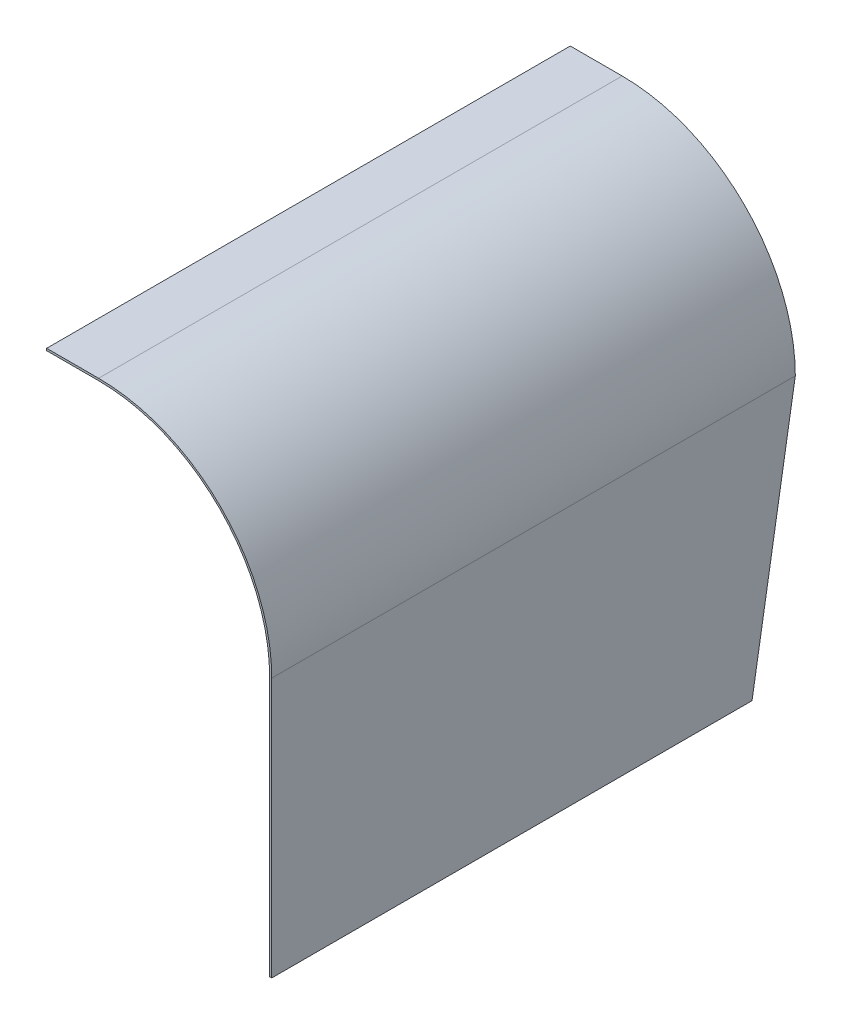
from build123d import *

# Parameters (mm, degrees)
EXTRUDE_THIN1_DEPTH = 302.428
EXTRUDE3_DEPTH      = 10


with BuildPart() as part:
    # Sketch4 → Extrude-Thin1 (new body)
    with BuildSketch(Plane.XY):
        with BuildLine():
            Line((0, 0), (30, 0))
            ThreePointArc((30, 0), (100.710678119, -29.289321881), (130, -100))
            Line((130, -100), (130, -250))
            Line((130, -250), (128.786, -250))
            Line((128.786, -250), (128.786, -100))
            ThreePointArc((128.786, -100), (99.852250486, -30.147749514), (30, -1.214))
            Line((30, -1.214), (0, -1.214))
            Line((0, -1.214), (0, 0))
        make_face()
    extrude(amount=EXTRUDE_THIN1_DEPTH)

    # Sketch8 → Extrude3 (cut)
    with BuildSketch(Plane(origin=(130, 0, 0), x_dir=(0, 0, -1), z_dir=(1, 0, 0))):
        Polygon((0, -250), (0, -100), (-25, -250), align=None)
    extrude(amount=-EXTRUDE3_DEPTH, mode=Mode.SUBTRACT)


solid = part.part
